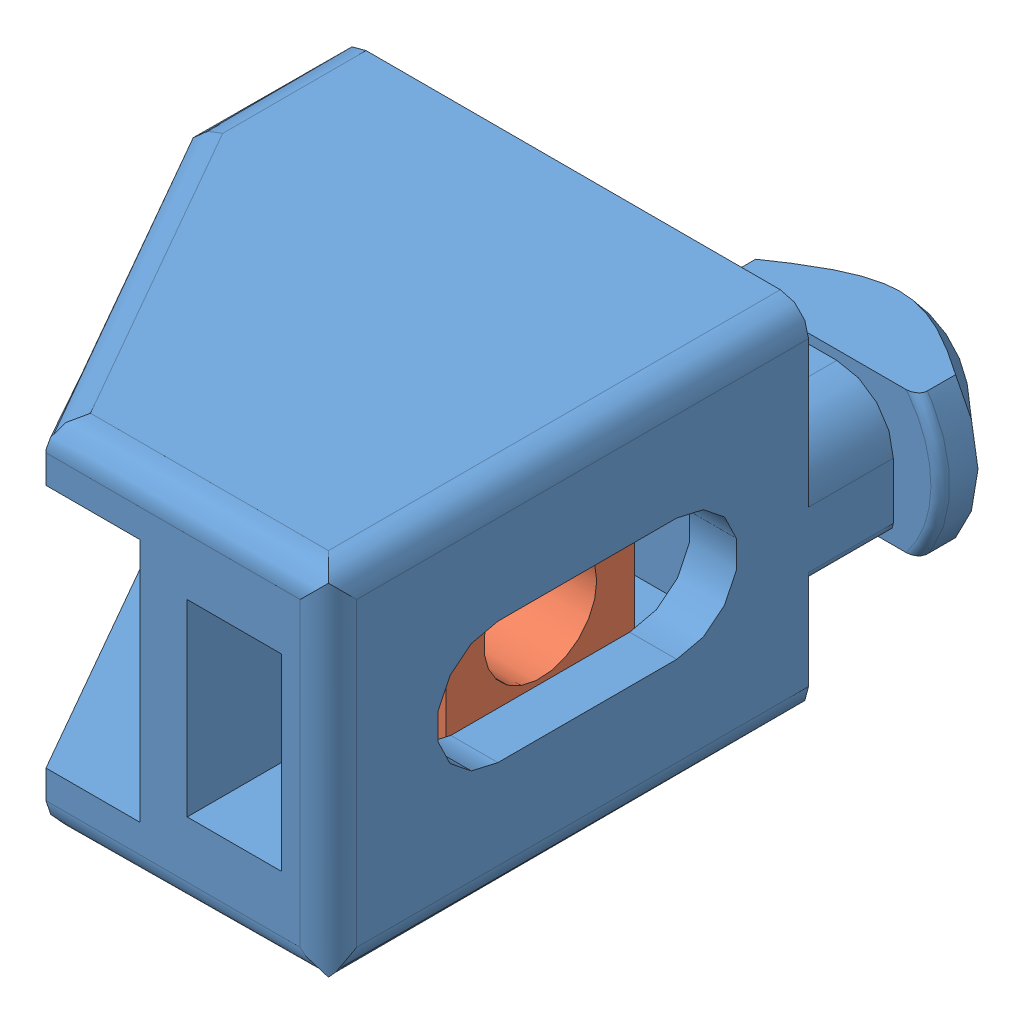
SolidWorks assembly 22.1112_1 SCREW BLOCK 32.SLDASM, configuration Default (file format 3800). Lengths in mm.
Overall size (27.5 19 35).
2 component instances, 2 part files, 3 mates.
Components (placement in the parent):
- 22.1112_1 SCREW BLOCK 32-1: 22.1112_1 SCREW BLOCK 32.SLDPRT [Default] at origin size (27.5 19 35)
- 22.1112_1 SCREW BLOCK 32 NUT-1: 22.1112_1 SCREW BLOCK 32 NUT.SLDPRT [Default] at (-0.68 0 21.25) x (0 0 -1) z (1 0 0) size (10 10 5)
Mates (geometry in assembly coordinates):
- Coincident1: coincident: plane of 22.1112_1 SCREW BLOCK 32-1 through (0 0 0) normal (0 0 1); plane of ? through (-0.68 0 17.3474) normal (0 1 0)
- Coincident2: coincident: plane of 22.1112_1 SCREW BLOCK 32-1 through (4.32 0 37) normal (-1 0 0); plane of ? through (4.32 0 17.3474) normal (1 0 0)
- Distance2: distance = 4.75 mm: axis of 22.1112_1 SCREW BLOCK 32 NUT-1; axis of 22.1112_1 SCREW BLOCK 32-1
